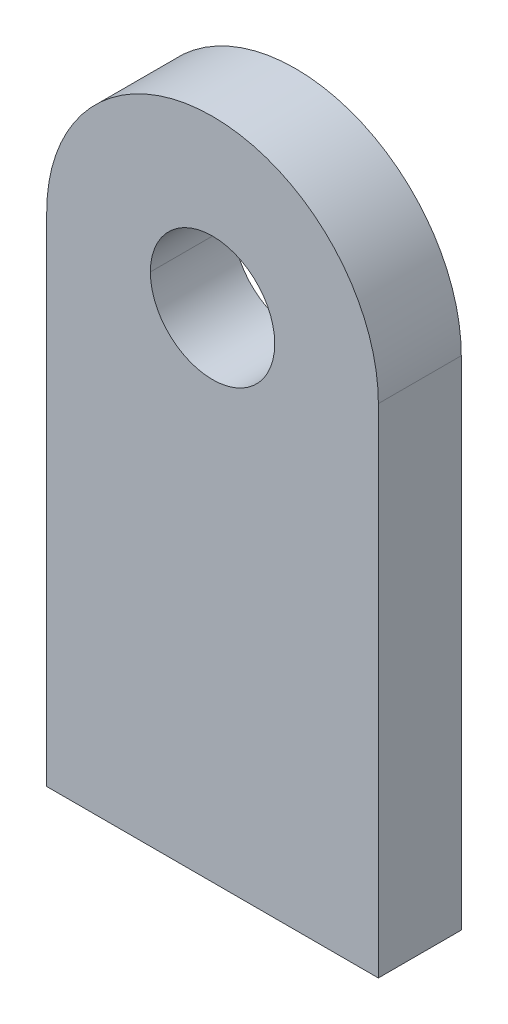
from build123d import *

# Parameters (mm, degrees)
EXTRUDE1_DEPTH     = 6.35
SKETCH2_R          = 9.525
CUT_EXTRUDE1_DEPTH = 106.494123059


with BuildPart() as part:
    # Sketch1 → Extrude1 (new, symmetric)
    with BuildSketch(Plane.XY):
        with BuildLine():
            Line((-25.4, 0), (-25.4, 76.2))
            ThreePointArc((-25.4, 76.2), (0, 101.6), (25.4, 76.2))
            Line((25.4, 76.2), (25.4, 0))
            Line((25.4, 0), (-25.4, 0))
        make_face()
    extrude(amount=EXTRUDE1_DEPTH, both=True)

    # Sketch2 → Cut-Extrude1 (cut, through all)
    with BuildSketch(Plane.XY.offset(6.35)):
        with Locations((0, 76.2)):
            Circle(SKETCH2_R)
    extrude(amount=-CUT_EXTRUDE1_DEPTH, mode=Mode.SUBTRACT)


solid = part.part
